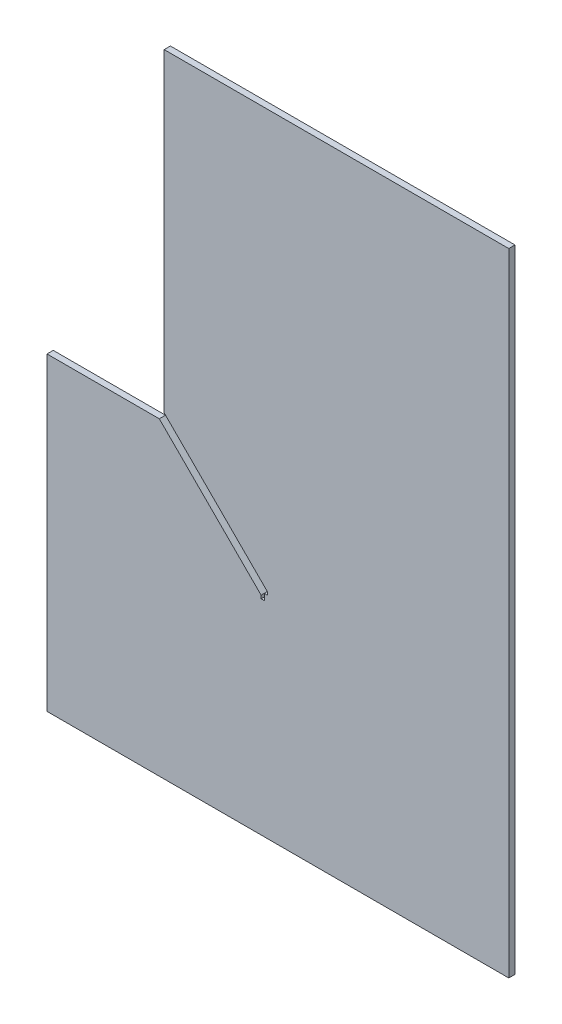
ISO-10303-21;
HEADER;
FILE_DESCRIPTION(('STEP AP214'),'2;1');
FILE_NAME('part.step','',(''),(''),'','','');
FILE_SCHEMA(('AUTOMOTIVE_DESIGN { 1 0 10303 214 1 1 1 1 }'));
ENDSEC;
DATA;
#1=APPLICATION_CONTEXT('core data for automotive mechanical design processes');
#2=APPLICATION_PROTOCOL_DEFINITION('international standard','automotive_design',2000,#1);
#3=PRODUCT_CONTEXT('',#1,'mechanical');
#4=PRODUCT('Part','Part','',(#3));
#5=PRODUCT_RELATED_PRODUCT_CATEGORY('part','',(#4));
#6=PRODUCT_DEFINITION_FORMATION('','',#4);
#7=PRODUCT_DEFINITION_CONTEXT('part definition',#1,'design');
#8=PRODUCT_DEFINITION('design','',#6,#7);
#9=PRODUCT_DEFINITION_SHAPE('','',#8);
#10=(LENGTH_UNIT() NAMED_UNIT(*) SI_UNIT(.MILLI.,.METRE.));
#11=(NAMED_UNIT(*) PLANE_ANGLE_UNIT() SI_UNIT($,.RADIAN.));
#12=(NAMED_UNIT(*) SI_UNIT($,.STERADIAN.) SOLID_ANGLE_UNIT());
#13=UNCERTAINTY_MEASURE_WITH_UNIT(LENGTH_MEASURE(1.E-05),#10,'distance_accuracy_value','');
#14=(GEOMETRIC_REPRESENTATION_CONTEXT(3) GLOBAL_UNCERTAINTY_ASSIGNED_CONTEXT((#13)) GLOBAL_UNIT_ASSIGNED_CONTEXT((#10,
#11,#12)) REPRESENTATION_CONTEXT('',''));
#15=CARTESIAN_POINT('',(0.,0.,0.));
#16=DIRECTION('',(0.,0.,1.));
#17=DIRECTION('',(1.,0.,0.));
#18=AXIS2_PLACEMENT_3D('',#15,#16,#17);
#19=CARTESIAN_POINT('',(0.,0.,-1.));
#20=DIRECTION('',(0.,0.,1.));
#21=DIRECTION('',(1.,0.,0.));
#22=AXIS2_PLACEMENT_3D('',#19,#20,#21);
#23=PLANE('',#22);
#24=DIRECTION('',(0.,-1.,0.));
#25=VECTOR('',#24,1.);
#26=CARTESIAN_POINT('',(35.3909795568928,34.3600250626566,-1.));
#27=LINE('',#26,#25);
#28=CARTESIAN_POINT('',(35.3909795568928,34.3600250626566,-1.));
#29=VERTEX_POINT('',#28);
#30=CARTESIAN_POINT('',(35.3909795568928,33.8600250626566,-1.));
#31=VERTEX_POINT('',#30);
#32=EDGE_CURVE('E194',#29,#31,#27,.T.);
#33=ORIENTED_EDGE('',*,*,#32,.F.);
#34=DIRECTION('',(-0.707106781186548,0.707106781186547,0.));
#35=VECTOR('',#34,1.);
#36=CARTESIAN_POINT('',(34.8755023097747,34.8755023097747,-1.));
#37=LINE('',#36,#35);
#38=CARTESIAN_POINT('',(18.8201832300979,50.9308213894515,-0.999999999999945));
#39=VERTEX_POINT('',#38);
#40=EDGE_CURVE('E203',#29,#39,#37,.T.);
#41=ORIENTED_EDGE('',*,*,#40,.T.);
#42=DIRECTION('',(0.,-1.,0.));
#43=VECTOR('',#42,1.);
#44=CARTESIAN_POINT('',(18.8201832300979,49.3600250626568,-0.999999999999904));
#45=LINE('',#44,#43);
#46=CARTESIAN_POINT('',(18.8201832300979,101.456766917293,-0.999999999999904));
#47=VERTEX_POINT('',#46);
#48=EDGE_CURVE('E191',#47,#39,#45,.T.);
#49=ORIENTED_EDGE('',*,*,#48,.F.);
#50=DIRECTION('',(-1.,0.,0.));
#51=VECTOR('',#50,1.);
#52=CARTESIAN_POINT('',(74.1620321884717,101.456766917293,-1.));
#53=LINE('',#52,#51);
#54=CARTESIAN_POINT('',(74.1620321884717,101.456766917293,-1.));
#55=VERTEX_POINT('',#54);
#56=EDGE_CURVE('E229',#55,#47,#53,.T.);
#57=ORIENTED_EDGE('',*,*,#56,.F.);
#58=DIRECTION('',(0.,1.,0.));
#59=VECTOR('',#58,1.);
#60=CARTESIAN_POINT('',(74.1620321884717,0.,-1.));
#61=LINE('',#60,#59);
#62=CARTESIAN_POINT('',(74.1620321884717,0.,-1.));
#63=VERTEX_POINT('',#62);
#64=EDGE_CURVE('E226',#63,#55,#61,.T.);
#65=ORIENTED_EDGE('',*,*,#64,.F.);
#66=DIRECTION('',(1.,0.,0.));
#67=VECTOR('',#66,1.);
#68=CARTESIAN_POINT('',(0.,0.,-1.));
#69=LINE('',#68,#67);
#70=CARTESIAN_POINT('',(0.,0.,-1.));
#71=VERTEX_POINT('',#70);
#72=EDGE_CURVE('E222',#71,#63,#69,.T.);
#73=ORIENTED_EDGE('',*,*,#72,.F.);
#74=DIRECTION('',(0.,-1.,0.));
#75=VECTOR('',#74,1.);
#76=CARTESIAN_POINT('',(0.,34.3600250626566,-1.));
#77=LINE('',#76,#75);
#78=CARTESIAN_POINT('',(0.,49.716219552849,-0.99999999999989));
#79=VERTEX_POINT('',#78);
#80=EDGE_CURVE('E220',#79,#71,#77,.T.);
#81=ORIENTED_EDGE('',*,*,#80,.F.);
#82=DIRECTION('',(-1.,0.,0.));
#83=VECTOR('',#82,1.);
#84=CARTESIAN_POINT('',(0.,49.716219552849,-0.99999999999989));
#85=LINE('',#84,#83);
#86=CARTESIAN_POINT('',(18.0347850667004,49.716219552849,-0.99999999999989));
#87=VERTEX_POINT('',#86);
#88=EDGE_CURVE('E172',#87,#79,#85,.T.);
#89=ORIENTED_EDGE('',*,*,#88,.F.);
#90=DIRECTION('',(0.707106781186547,-0.707106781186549,0.));
#91=VECTOR('',#90,1.);
#92=CARTESIAN_POINT('',(32.0347850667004,35.716219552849,-0.99999999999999));
#93=LINE('',#92,#91);
#94=CARTESIAN_POINT('',(34.3909795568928,33.3600250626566,-0.99999999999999));
#95=VERTEX_POINT('',#94);
#96=EDGE_CURVE('E163',#87,#95,#93,.T.);
#97=ORIENTED_EDGE('',*,*,#96,.T.);
#98=DIRECTION('',(0.,1.,0.));
#99=VECTOR('',#98,1.);
#100=CARTESIAN_POINT('',(34.3909795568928,32.8600250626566,-0.99999999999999));
#101=LINE('',#100,#99);
#102=CARTESIAN_POINT('',(34.3909795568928,32.8600250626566,-0.99999999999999));
#103=VERTEX_POINT('',#102);
#104=EDGE_CURVE('E217',#103,#95,#101,.T.);
#105=ORIENTED_EDGE('',*,*,#104,.F.);
#106=DIRECTION('',(-1.,0.,0.));
#107=VECTOR('',#106,1.);
#108=CARTESIAN_POINT('',(34.8909795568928,32.8600250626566,-0.99999999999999));
#109=LINE('',#108,#107);
#110=CARTESIAN_POINT('',(34.8909795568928,32.8600250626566,-0.99999999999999));
#111=VERTEX_POINT('',#110);
#112=EDGE_CURVE('E211',#111,#103,#109,.T.);
#113=ORIENTED_EDGE('',*,*,#112,.F.);
#114=DIRECTION('',(0.,-1.,0.));
#115=VECTOR('',#114,1.);
#116=CARTESIAN_POINT('',(34.8909795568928,34.3600250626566,-0.99999999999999));
#117=LINE('',#116,#115);
#118=CARTESIAN_POINT('',(34.8909795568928,33.8600250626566,-0.99999999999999));
#119=VERTEX_POINT('',#118);
#120=EDGE_CURVE('E208',#119,#111,#117,.T.);
#121=ORIENTED_EDGE('',*,*,#120,.F.);
#122=DIRECTION('',(-1.,0.,0.));
#123=VECTOR('',#122,1.);
#124=CARTESIAN_POINT('',(35.3909795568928,33.8600250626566,-1.));
#125=LINE('',#124,#123);
#126=EDGE_CURVE('E85',#31,#119,#125,.T.);
#127=ORIENTED_EDGE('',*,*,#126,.F.);
#128=EDGE_LOOP('',(#33,#41,#49,#57,#65,#73,#81,#89,#97,#105,#113,#121,#127));
#129=FACE_BOUND('',#128,.T.);
#130=ADVANCED_FACE('F63',(#129),#23,.F.);
#131=CARTESIAN_POINT('',(0.,0.,0.));
#132=DIRECTION('',(0.,0.,1.));
#133=DIRECTION('',(1.,0.,0.));
#134=AXIS2_PLACEMENT_3D('',#131,#132,#133);
#135=PLANE('',#134);
#136=DIRECTION('',(-0.707106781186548,0.707106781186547,0.));
#137=VECTOR('',#136,1.);
#138=CARTESIAN_POINT('',(18.8201832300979,50.9308213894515,0.));
#139=LINE('',#138,#137);
#140=CARTESIAN_POINT('',(35.3909795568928,34.3600250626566,0.));
#141=VERTEX_POINT('',#140);
#142=CARTESIAN_POINT('',(18.8201832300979,50.9308213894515,0.));
#143=VERTEX_POINT('',#142);
#144=EDGE_CURVE('E184',#141,#143,#139,.T.);
#145=ORIENTED_EDGE('',*,*,#144,.F.);
#146=DIRECTION('',(0.,-1.,0.));
#147=VECTOR('',#146,1.);
#148=CARTESIAN_POINT('',(35.3909795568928,0.,0.));
#149=LINE('',#148,#147);
#150=CARTESIAN_POINT('',(35.3909795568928,33.8600250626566,0.));
#151=VERTEX_POINT('',#150);
#152=EDGE_CURVE('E71',#141,#151,#149,.T.);
#153=ORIENTED_EDGE('',*,*,#152,.T.);
#154=DIRECTION('',(-1.,0.,0.));
#155=VECTOR('',#154,1.);
#156=CARTESIAN_POINT('',(0.,33.8600250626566,0.));
#157=LINE('',#156,#155);
#158=CARTESIAN_POINT('',(34.8909795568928,33.8600250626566,0.));
#159=VERTEX_POINT('',#158);
#160=EDGE_CURVE('E197',#151,#159,#157,.T.);
#161=ORIENTED_EDGE('',*,*,#160,.T.);
#162=DIRECTION('',(0.,-1.,0.));
#163=VECTOR('',#162,1.);
#164=CARTESIAN_POINT('',(34.8909795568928,0.,0.));
#165=LINE('',#164,#163);
#166=CARTESIAN_POINT('',(34.8909795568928,32.8600250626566,0.));
#167=VERTEX_POINT('',#166);
#168=EDGE_CURVE('E248',#159,#167,#165,.T.);
#169=ORIENTED_EDGE('',*,*,#168,.T.);
#170=DIRECTION('',(-1.,0.,0.));
#171=VECTOR('',#170,1.);
#172=CARTESIAN_POINT('',(0.,32.8600250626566,0.));
#173=LINE('',#172,#171);
#174=CARTESIAN_POINT('',(34.3909795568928,32.8600250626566,0.));
#175=VERTEX_POINT('',#174);
#176=EDGE_CURVE('E246',#167,#175,#173,.T.);
#177=ORIENTED_EDGE('',*,*,#176,.T.);
#178=DIRECTION('',(0.,1.,0.));
#179=VECTOR('',#178,1.);
#180=CARTESIAN_POINT('',(34.3909795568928,0.,0.));
#181=LINE('',#180,#179);
#182=CARTESIAN_POINT('',(34.3909795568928,33.3600250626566,0.));
#183=VERTEX_POINT('',#182);
#184=EDGE_CURVE('E161',#175,#183,#181,.T.);
#185=ORIENTED_EDGE('',*,*,#184,.T.);
#186=DIRECTION('',(0.707106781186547,-0.707106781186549,0.));
#187=VECTOR('',#186,1.);
#188=CARTESIAN_POINT('',(32.0347850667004,35.716219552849,0.));
#189=LINE('',#188,#187);
#190=CARTESIAN_POINT('',(18.0347850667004,49.716219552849,1.11022302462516E-13));
#191=VERTEX_POINT('',#190);
#192=EDGE_CURVE('E77',#191,#183,#189,.T.);
#193=ORIENTED_EDGE('',*,*,#192,.F.);
#194=DIRECTION('',(-1.,0.,0.));
#195=VECTOR('',#194,1.);
#196=CARTESIAN_POINT('',(0.,49.716219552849,1.11022302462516E-13));
#197=LINE('',#196,#195);
#198=CARTESIAN_POINT('',(0.,49.716219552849,1.11022302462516E-13));
#199=VERTEX_POINT('',#198);
#200=EDGE_CURVE('E158',#191,#199,#197,.T.);
#201=ORIENTED_EDGE('',*,*,#200,.T.);
#202=DIRECTION('',(0.,-1.,0.));
#203=VECTOR('',#202,1.);
#204=CARTESIAN_POINT('',(0.,34.3600250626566,0.));
#205=LINE('',#204,#203);
#206=CARTESIAN_POINT('',(0.,0.,0.));
#207=VERTEX_POINT('',#206);
#208=EDGE_CURVE('E210',#199,#207,#205,.T.);
#209=ORIENTED_EDGE('',*,*,#208,.T.);
#210=DIRECTION('',(1.,0.,0.));
#211=VECTOR('',#210,1.);
#212=CARTESIAN_POINT('',(0.,0.,0.));
#213=LINE('',#212,#211);
#214=CARTESIAN_POINT('',(74.1620321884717,0.,0.));
#215=VERTEX_POINT('',#214);
#216=EDGE_CURVE('E233',#207,#215,#213,.T.);
#217=ORIENTED_EDGE('',*,*,#216,.T.);
#218=DIRECTION('',(0.,1.,0.));
#219=VECTOR('',#218,1.);
#220=CARTESIAN_POINT('',(74.1620321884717,0.,0.));
#221=LINE('',#220,#219);
#222=CARTESIAN_POINT('',(74.1620321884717,101.456766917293,0.));
#223=VERTEX_POINT('',#222);
#224=EDGE_CURVE('E236',#215,#223,#221,.T.);
#225=ORIENTED_EDGE('',*,*,#224,.T.);
#226=DIRECTION('',(-1.,0.,0.));
#227=VECTOR('',#226,1.);
#228=CARTESIAN_POINT('',(74.1620321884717,101.456766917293,0.));
#229=LINE('',#228,#227);
#230=CARTESIAN_POINT('',(18.8201832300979,101.456766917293,0.));
#231=VERTEX_POINT('',#230);
#232=EDGE_CURVE('E223',#223,#231,#229,.T.);
#233=ORIENTED_EDGE('',*,*,#232,.T.);
#234=DIRECTION('',(0.,-1.,0.));
#235=VECTOR('',#234,1.);
#236=CARTESIAN_POINT('',(18.8201832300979,49.3600250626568,0.));
#237=LINE('',#236,#235);
#238=EDGE_CURVE('E181',#231,#143,#237,.T.);
#239=ORIENTED_EDGE('',*,*,#238,.T.);
#240=EDGE_LOOP('',(#145,#153,#161,#169,#177,#185,#193,#201,#209,#217,#225,#233,#239));
#241=FACE_BOUND('',#240,.T.);
#242=ADVANCED_FACE('F65',(#241),#135,.T.);
#243=CARTESIAN_POINT('',(74.1620321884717,101.456766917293,-1.));
#244=DIRECTION('',(0.,1.,0.));
#245=DIRECTION('',(0.,0.,1.));
#246=AXIS2_PLACEMENT_3D('',#243,#244,#245);
#247=PLANE('',#246);
#248=ORIENTED_EDGE('',*,*,#56,.T.);
#249=DIRECTION('',(0.,0.,-1.));
#250=VECTOR('',#249,1.);
#251=CARTESIAN_POINT('',(18.8201832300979,101.456766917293,0.));
#252=LINE('',#251,#250);
#253=EDGE_CURVE('E185',#231,#47,#252,.T.);
#254=ORIENTED_EDGE('',*,*,#253,.F.);
#255=ORIENTED_EDGE('',*,*,#232,.F.);
#256=DIRECTION('',(0.,0.,1.));
#257=VECTOR('',#256,1.);
#258=CARTESIAN_POINT('',(74.1620321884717,101.456766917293,-1.));
#259=LINE('',#258,#257);
#260=EDGE_CURVE('E240',#55,#223,#259,.T.);
#261=ORIENTED_EDGE('',*,*,#260,.F.);
#262=EDGE_LOOP('',(#248,#254,#255,#261));
#263=FACE_BOUND('',#262,.T.);
#264=ADVANCED_FACE('F295',(#263),#247,.T.);
#265=CARTESIAN_POINT('',(34.8909795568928,34.3600250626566,-0.99999999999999));
#266=DIRECTION('',(-1.,0.,0.));
#267=DIRECTION('',(0.,0.,1.));
#268=AXIS2_PLACEMENT_3D('',#265,#266,#267);
#269=PLANE('',#268);
#270=ORIENTED_EDGE('',*,*,#168,.F.);
#271=DIRECTION('',(0.,0.,-1.));
#272=VECTOR('',#271,1.);
#273=CARTESIAN_POINT('',(34.8909795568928,33.8600250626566,-0.99999999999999));
#274=LINE('',#273,#272);
#275=EDGE_CURVE('E250',#159,#119,#274,.T.);
#276=ORIENTED_EDGE('',*,*,#275,.T.);
#277=ORIENTED_EDGE('',*,*,#120,.T.);
#278=DIRECTION('',(0.,0.,1.));
#279=VECTOR('',#278,1.);
#280=CARTESIAN_POINT('',(34.8909795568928,32.8600250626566,-0.99999999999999));
#281=LINE('',#280,#279);
#282=EDGE_CURVE('E214',#111,#167,#281,.T.);
#283=ORIENTED_EDGE('',*,*,#282,.T.);
#284=EDGE_LOOP('',(#270,#276,#277,#283));
#285=FACE_BOUND('',#284,.T.);
#286=ADVANCED_FACE('F278',(#285),#269,.T.);
#287=CARTESIAN_POINT('',(0.,34.3600250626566,-1.));
#288=DIRECTION('',(-1.,0.,0.));
#289=DIRECTION('',(0.,0.,1.));
#290=AXIS2_PLACEMENT_3D('',#287,#288,#289);
#291=PLANE('',#290);
#292=ORIENTED_EDGE('',*,*,#208,.F.);
#293=DIRECTION('',(0.,0.,-1.));
#294=VECTOR('',#293,1.);
#295=CARTESIAN_POINT('',(0.,49.716219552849,1.11022302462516E-13));
#296=LINE('',#295,#294);
#297=EDGE_CURVE('E176',#199,#79,#296,.T.);
#298=ORIENTED_EDGE('',*,*,#297,.T.);
#299=ORIENTED_EDGE('',*,*,#80,.T.);
#300=DIRECTION('',(0.,0.,1.));
#301=VECTOR('',#300,1.);
#302=CARTESIAN_POINT('',(0.,0.,-1.));
#303=LINE('',#302,#301);
#304=EDGE_CURVE('E231',#71,#207,#303,.T.);
#305=ORIENTED_EDGE('',*,*,#304,.T.);
#306=EDGE_LOOP('',(#292,#298,#299,#305));
#307=FACE_BOUND('',#306,.T.);
#308=ADVANCED_FACE('F306',(#307),#291,.T.);
#309=CARTESIAN_POINT('',(74.1620321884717,0.,-1.));
#310=DIRECTION('',(1.,0.,0.));
#311=DIRECTION('',(0.,0.,-1.));
#312=AXIS2_PLACEMENT_3D('',#309,#310,#311);
#313=PLANE('',#312);
#314=ORIENTED_EDGE('',*,*,#224,.F.);
#315=DIRECTION('',(0.,0.,1.));
#316=VECTOR('',#315,1.);
#317=CARTESIAN_POINT('',(74.1620321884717,0.,-1.));
#318=LINE('',#317,#316);
#319=EDGE_CURVE('E242',#63,#215,#318,.T.);
#320=ORIENTED_EDGE('',*,*,#319,.F.);
#321=ORIENTED_EDGE('',*,*,#64,.T.);
#322=ORIENTED_EDGE('',*,*,#260,.T.);
#323=EDGE_LOOP('',(#314,#320,#321,#322));
#324=FACE_BOUND('',#323,.T.);
#325=ADVANCED_FACE('F300',(#324),#313,.T.);
#326=CARTESIAN_POINT('',(0.,0.,-1.));
#327=DIRECTION('',(0.,-1.,0.));
#328=DIRECTION('',(0.,0.,-1.));
#329=AXIS2_PLACEMENT_3D('',#326,#327,#328);
#330=PLANE('',#329);
#331=ORIENTED_EDGE('',*,*,#216,.F.);
#332=ORIENTED_EDGE('',*,*,#304,.F.);
#333=ORIENTED_EDGE('',*,*,#72,.T.);
#334=ORIENTED_EDGE('',*,*,#319,.T.);
#335=EDGE_LOOP('',(#331,#332,#333,#334));
#336=FACE_BOUND('',#335,.T.);
#337=ADVANCED_FACE('F303',(#336),#330,.T.);
#338=CARTESIAN_POINT('',(34.8909795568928,32.8600250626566,-0.99999999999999));
#339=DIRECTION('',(0.,1.,0.));
#340=DIRECTION('',(0.,0.,1.));
#341=AXIS2_PLACEMENT_3D('',#338,#339,#340);
#342=PLANE('',#341);
#343=ORIENTED_EDGE('',*,*,#176,.F.);
#344=ORIENTED_EDGE('',*,*,#282,.F.);
#345=ORIENTED_EDGE('',*,*,#112,.T.);
#346=DIRECTION('',(0.,0.,1.));
#347=VECTOR('',#346,1.);
#348=CARTESIAN_POINT('',(34.3909795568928,32.8600250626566,-0.99999999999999));
#349=LINE('',#348,#347);
#350=EDGE_CURVE('E207',#103,#175,#349,.T.);
#351=ORIENTED_EDGE('',*,*,#350,.T.);
#352=EDGE_LOOP('',(#343,#344,#345,#351));
#353=FACE_BOUND('',#352,.T.);
#354=ADVANCED_FACE('F274',(#353),#342,.T.);
#355=CARTESIAN_POINT('',(34.3909795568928,32.8600250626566,-0.99999999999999));
#356=DIRECTION('',(1.,0.,0.));
#357=DIRECTION('',(0.,0.,-1.));
#358=AXIS2_PLACEMENT_3D('',#355,#356,#357);
#359=PLANE('',#358);
#360=ORIENTED_EDGE('',*,*,#184,.F.);
#361=ORIENTED_EDGE('',*,*,#350,.F.);
#362=ORIENTED_EDGE('',*,*,#104,.T.);
#363=DIRECTION('',(0.,0.,-1.));
#364=VECTOR('',#363,1.);
#365=CARTESIAN_POINT('',(34.3909795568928,33.3600250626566,-0.99999999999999));
#366=LINE('',#365,#364);
#367=EDGE_CURVE('E12',#183,#95,#366,.T.);
#368=ORIENTED_EDGE('',*,*,#367,.F.);
#369=EDGE_LOOP('',(#360,#361,#362,#368));
#370=FACE_BOUND('',#369,.T.);
#371=ADVANCED_FACE('F270',(#370),#359,.T.);
#372=CARTESIAN_POINT('',(35.3909795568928,34.3600250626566,-1.));
#373=DIRECTION('',(-1.,0.,0.));
#374=DIRECTION('',(0.,0.,1.));
#375=AXIS2_PLACEMENT_3D('',#372,#373,#374);
#376=PLANE('',#375);
#377=ORIENTED_EDGE('',*,*,#152,.F.);
#378=DIRECTION('',(0.,0.,1.));
#379=VECTOR('',#378,1.);
#380=CARTESIAN_POINT('',(35.3909795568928,34.3600250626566,-1.));
#381=LINE('',#380,#379);
#382=EDGE_CURVE('E198',#29,#141,#381,.T.);
#383=ORIENTED_EDGE('',*,*,#382,.F.);
#384=ORIENTED_EDGE('',*,*,#32,.T.);
#385=DIRECTION('',(0.,0.,1.));
#386=VECTOR('',#385,1.);
#387=CARTESIAN_POINT('',(35.3909795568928,33.8600250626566,-1.));
#388=LINE('',#387,#386);
#389=EDGE_CURVE('E200',#31,#151,#388,.T.);
#390=ORIENTED_EDGE('',*,*,#389,.T.);
#391=EDGE_LOOP('',(#377,#383,#384,#390));
#392=FACE_BOUND('',#391,.T.);
#393=ADVANCED_FACE('F283',(#392),#376,.T.);
#394=CARTESIAN_POINT('',(35.3909795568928,33.8600250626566,-1.));
#395=DIRECTION('',(0.,1.,0.));
#396=DIRECTION('',(0.,0.,1.));
#397=AXIS2_PLACEMENT_3D('',#394,#395,#396);
#398=PLANE('',#397);
#399=ORIENTED_EDGE('',*,*,#160,.F.);
#400=ORIENTED_EDGE('',*,*,#389,.F.);
#401=ORIENTED_EDGE('',*,*,#126,.T.);
#402=ORIENTED_EDGE('',*,*,#275,.F.);
#403=EDGE_LOOP('',(#399,#400,#401,#402));
#404=FACE_BOUND('',#403,.T.);
#405=ADVANCED_FACE('F279',(#404),#398,.T.);
#406=CARTESIAN_POINT('',(18.8201832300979,50.9308213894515,-1.002525));
#407=DIRECTION('',(0.707106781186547,0.707106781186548,0.));
#408=DIRECTION('',(-0.707106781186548,0.707106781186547,0.));
#409=AXIS2_PLACEMENT_3D('',#406,#407,#408);
#410=PLANE('',#409);
#411=ORIENTED_EDGE('',*,*,#144,.T.);
#412=DIRECTION('',(0.,0.,1.));
#413=VECTOR('',#412,1.);
#414=CARTESIAN_POINT('',(18.8201832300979,50.9308213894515,-1.002525));
#415=LINE('',#414,#413);
#416=EDGE_CURVE('E188',#39,#143,#415,.T.);
#417=ORIENTED_EDGE('',*,*,#416,.F.);
#418=ORIENTED_EDGE('',*,*,#40,.F.);
#419=ORIENTED_EDGE('',*,*,#382,.T.);
#420=EDGE_LOOP('',(#411,#417,#418,#419));
#421=FACE_BOUND('',#420,.T.);
#422=ADVANCED_FACE('F288',(#421),#410,.F.);
#423=CARTESIAN_POINT('',(18.8201832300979,49.3600250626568,0.));
#424=DIRECTION('',(1.,0.,0.));
#425=DIRECTION('',(0.,0.,-1.));
#426=AXIS2_PLACEMENT_3D('',#423,#424,#425);
#427=PLANE('',#426);
#428=ORIENTED_EDGE('',*,*,#48,.T.);
#429=ORIENTED_EDGE('',*,*,#416,.T.);
#430=ORIENTED_EDGE('',*,*,#238,.F.);
#431=ORIENTED_EDGE('',*,*,#253,.T.);
#432=EDGE_LOOP('',(#428,#429,#430,#431));
#433=FACE_BOUND('',#432,.T.);
#434=ADVANCED_FACE('F291',(#433),#427,.F.);
#435=CARTESIAN_POINT('',(32.0347850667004,35.716219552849,-0.99999999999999));
#436=DIRECTION('',(0.707106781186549,0.707106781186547,0.));
#437=DIRECTION('',(0.707106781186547,-0.707106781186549,0.));
#438=AXIS2_PLACEMENT_3D('',#435,#436,#437);
#439=PLANE('',#438);
#440=ORIENTED_EDGE('',*,*,#96,.F.);
#441=DIRECTION('',(0.,0.,-1.));
#442=VECTOR('',#441,1.);
#443=CARTESIAN_POINT('',(18.0347850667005,49.716219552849,0.));
#444=LINE('',#443,#442);
#445=EDGE_CURVE('E166',#191,#87,#444,.T.);
#446=ORIENTED_EDGE('',*,*,#445,.F.);
#447=ORIENTED_EDGE('',*,*,#192,.T.);
#448=ORIENTED_EDGE('',*,*,#367,.T.);
#449=EDGE_LOOP('',(#440,#446,#447,#448));
#450=FACE_BOUND('',#449,.T.);
#451=ADVANCED_FACE('F167',(#450),#439,.T.);
#452=CARTESIAN_POINT('',(0.,49.716219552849,1.11022302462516E-13));
#453=DIRECTION('',(0.,-1.,0.));
#454=DIRECTION('',(0.,0.,-1.));
#455=AXIS2_PLACEMENT_3D('',#452,#453,#454);
#456=PLANE('',#455);
#457=ORIENTED_EDGE('',*,*,#200,.F.);
#458=ORIENTED_EDGE('',*,*,#445,.T.);
#459=ORIENTED_EDGE('',*,*,#88,.T.);
#460=ORIENTED_EDGE('',*,*,#297,.F.);
#461=EDGE_LOOP('',(#457,#458,#459,#460));
#462=FACE_BOUND('',#461,.T.);
#463=ADVANCED_FACE('F174',(#462),#456,.F.);
#464=CLOSED_SHELL('',(#130,#242,#264,#286,#308,#325,#337,#354,#371,#393,#405,#422,#434,#451,#463));
#465=MANIFOLD_SOLID_BREP('B2',#464);
#466=ADVANCED_BREP_SHAPE_REPRESENTATION('',(#18,#465),#14);
#467=SHAPE_DEFINITION_REPRESENTATION(#9,#466);
ENDSEC;
END-ISO-10303-21;
